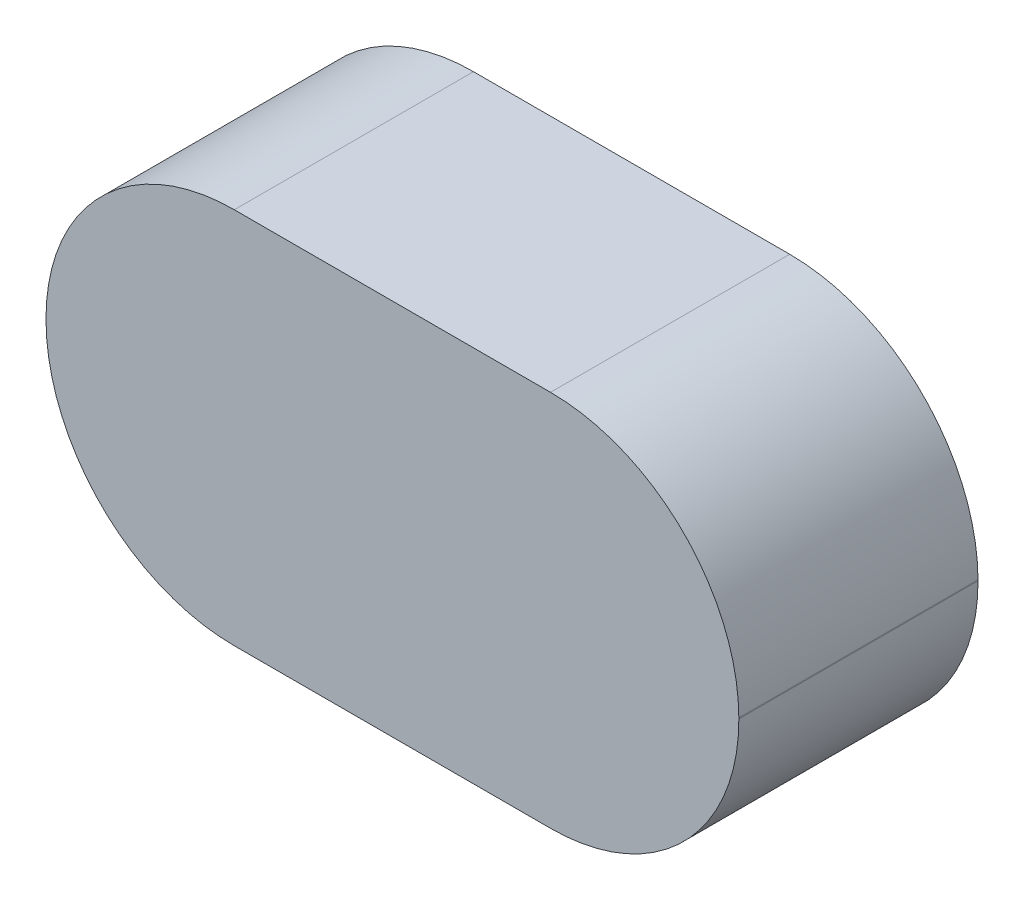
from build123d import *

# Parameters (mm, degrees)
BOSS_EXTRUDE1_DEPTH = 2.413
FILLET1_R           = 1.9


with BuildPart() as part:
    # Component_Outline → Boss-Extrude1 (new body)
    with BuildSketch(Plane.XY):
        Polygon((-3.5, 1.71), (3.485, 1.709984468), (3.495879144, -2.1), (-3.5, -2.1), align=None)
    extrude(amount=BOSS_EXTRUDE1_DEPTH)

    # Fillet1
    fillet1_edges = [part.edges().sort_by_distance(p)[0] for p in [
        (-3.5, 1.71, 1.2065),
        (3.485, 1.709984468, 1.2065),
        (3.495879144, -2.1, 1.2065),
        (-3.5, -2.1, 1.2065),
    ]]
    fillet(fillet1_edges, radius=FILLET1_R)


solid = part.part
